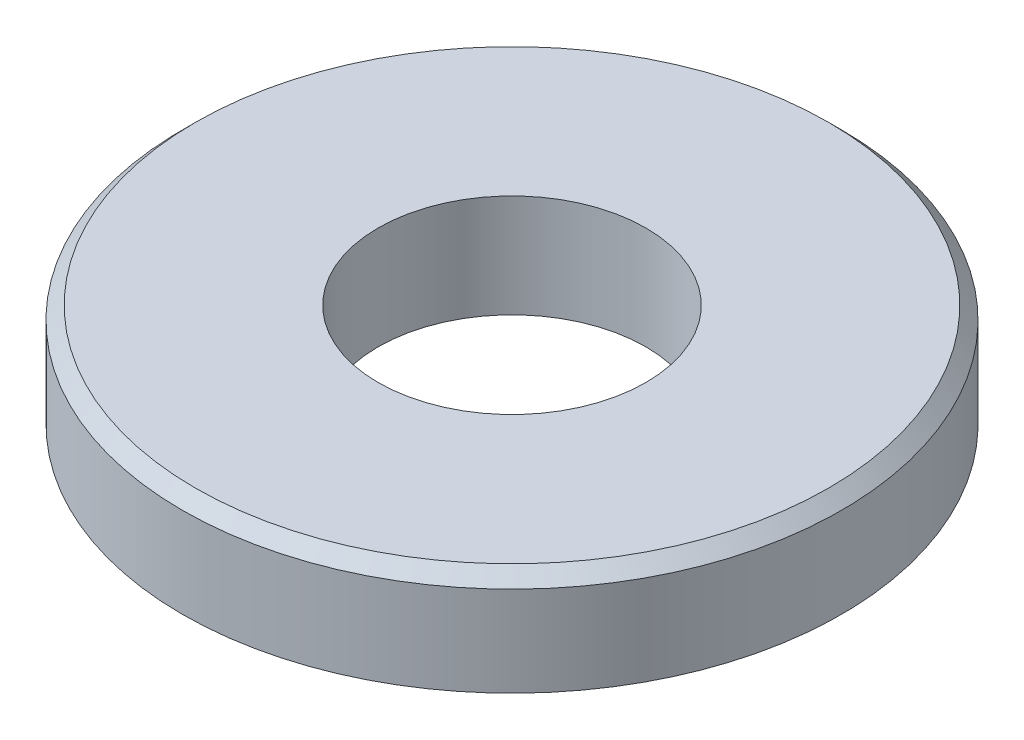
ISO-10303-21;
HEADER;
FILE_DESCRIPTION(('STEP AP214'),'2;1');
FILE_NAME('part.step','',(''),(''),'','','');
FILE_SCHEMA(('AUTOMOTIVE_DESIGN { 1 0 10303 214 1 1 1 1 }'));
ENDSEC;
DATA;
#1=APPLICATION_CONTEXT('core data for automotive mechanical design processes');
#2=APPLICATION_PROTOCOL_DEFINITION('international standard','automotive_design',2000,#1);
#3=PRODUCT_CONTEXT('',#1,'mechanical');
#4=PRODUCT('Part','Part','',(#3));
#5=PRODUCT_RELATED_PRODUCT_CATEGORY('part','',(#4));
#6=PRODUCT_DEFINITION_FORMATION('','',#4);
#7=PRODUCT_DEFINITION_CONTEXT('part definition',#1,'design');
#8=PRODUCT_DEFINITION('design','',#6,#7);
#9=PRODUCT_DEFINITION_SHAPE('','',#8);
#10=(LENGTH_UNIT() NAMED_UNIT(*) SI_UNIT(.MILLI.,.METRE.));
#11=(NAMED_UNIT(*) PLANE_ANGLE_UNIT() SI_UNIT($,.RADIAN.));
#12=(NAMED_UNIT(*) SI_UNIT($,.STERADIAN.) SOLID_ANGLE_UNIT());
#13=UNCERTAINTY_MEASURE_WITH_UNIT(LENGTH_MEASURE(1.E-05),#10,'distance_accuracy_value','');
#14=(GEOMETRIC_REPRESENTATION_CONTEXT(3) GLOBAL_UNCERTAINTY_ASSIGNED_CONTEXT((#13)) GLOBAL_UNIT_ASSIGNED_CONTEXT((#10,
#11,#12)) REPRESENTATION_CONTEXT('',''));
#15=CARTESIAN_POINT('',(0.,0.,0.));
#16=DIRECTION('',(0.,0.,1.));
#17=DIRECTION('',(1.,0.,0.));
#18=AXIS2_PLACEMENT_3D('',#15,#16,#17);
#19=CARTESIAN_POINT('',(0.,5.,0.));
#20=DIRECTION('',(0.,1.,0.));
#21=DIRECTION('',(0.,0.,1.));
#22=AXIS2_PLACEMENT_3D('',#19,#20,#21);
#23=PLANE('',#22);
#24=CARTESIAN_POINT('',(0.,5.,0.));
#25=DIRECTION('',(0.,1.,0.));
#26=DIRECTION('',(0.,0.,1.));
#27=AXIS2_PLACEMENT_3D('',#24,#25,#26);
#28=CIRCLE('',#27,15.375);
#29=CARTESIAN_POINT('',(0.,5.,15.375));
#30=VERTEX_POINT('',#29);
#31=EDGE_CURVE('E40',#30,#30,#28,.T.);
#32=ORIENTED_EDGE('',*,*,#31,.T.);
#33=EDGE_LOOP('',(#32));
#34=FACE_BOUND('',#33,.T.);
#35=CARTESIAN_POINT('',(0.,5.,0.));
#36=DIRECTION('',(0.,1.,0.));
#37=DIRECTION('',(0.,0.,1.));
#38=AXIS2_PLACEMENT_3D('',#35,#36,#37);
#39=CIRCLE('',#38,6.5);
#40=CARTESIAN_POINT('',(0.,5.,6.5));
#41=VERTEX_POINT('',#40);
#42=EDGE_CURVE('E48',#41,#41,#39,.T.);
#43=ORIENTED_EDGE('',*,*,#42,.F.);
#44=EDGE_LOOP('',(#43));
#45=FACE_BOUND('',#44,.T.);
#46=ADVANCED_FACE('F33',(#34,#45),#23,.T.);
#47=CARTESIAN_POINT('',(0.,0.,0.));
#48=DIRECTION('',(0.,1.,0.));
#49=DIRECTION('',(0.,0.,1.));
#50=AXIS2_PLACEMENT_3D('',#47,#48,#49);
#51=PLANE('',#50);
#52=CARTESIAN_POINT('',(0.,0.,0.));
#53=DIRECTION('',(0.,1.,0.));
#54=DIRECTION('',(0.,0.,1.));
#55=AXIS2_PLACEMENT_3D('',#52,#53,#54);
#56=CIRCLE('',#55,16.);
#57=CARTESIAN_POINT('',(0.,0.,16.));
#58=VERTEX_POINT('',#57);
#59=EDGE_CURVE('E44',#58,#58,#56,.T.);
#60=ORIENTED_EDGE('',*,*,#59,.F.);
#61=EDGE_LOOP('',(#60));
#62=FACE_BOUND('',#61,.T.);
#63=CARTESIAN_POINT('',(0.,0.,0.));
#64=DIRECTION('',(0.,1.,0.));
#65=DIRECTION('',(0.,0.,1.));
#66=AXIS2_PLACEMENT_3D('',#63,#64,#65);
#67=CIRCLE('',#66,6.5);
#68=CARTESIAN_POINT('',(0.,0.,6.5));
#69=VERTEX_POINT('',#68);
#70=EDGE_CURVE('E51',#69,#69,#67,.T.);
#71=ORIENTED_EDGE('',*,*,#70,.T.);
#72=EDGE_LOOP('',(#71));
#73=FACE_BOUND('',#72,.T.);
#74=ADVANCED_FACE('F61',(#62,#73),#51,.F.);
#75=CARTESIAN_POINT('',(0.,5.,0.));
#76=DIRECTION('',(0.,-1.,0.));
#77=DIRECTION('',(0.,0.,-1.));
#78=AXIS2_PLACEMENT_3D('',#75,#76,#77);
#79=CYLINDRICAL_SURFACE('',#78,16.);
#80=CARTESIAN_POINT('',(0.,4.375,0.));
#81=DIRECTION('',(0.,1.,0.));
#82=DIRECTION('',(0.,0.,1.));
#83=AXIS2_PLACEMENT_3D('',#80,#81,#82);
#84=CIRCLE('',#83,16.);
#85=CARTESIAN_POINT('',(0.,4.375,16.));
#86=VERTEX_POINT('',#85);
#87=EDGE_CURVE('E10',#86,#86,#84,.F.);
#88=ORIENTED_EDGE('',*,*,#87,.T.);
#89=EDGE_LOOP('',(#88));
#90=FACE_BOUND('',#89,.T.);
#91=ORIENTED_EDGE('',*,*,#59,.T.);
#92=EDGE_LOOP('',(#91));
#93=FACE_BOUND('',#92,.T.);
#94=ADVANCED_FACE('F66',(#90,#93),#79,.T.);
#95=CARTESIAN_POINT('',(0.,5.,0.));
#96=DIRECTION('',(0.,-1.,0.));
#97=DIRECTION('',(0.,0.,-1.));
#98=AXIS2_PLACEMENT_3D('',#95,#96,#97);
#99=CYLINDRICAL_SURFACE('',#98,6.5);
#100=ORIENTED_EDGE('',*,*,#42,.T.);
#101=EDGE_LOOP('',(#100));
#102=FACE_BOUND('',#101,.T.);
#103=ORIENTED_EDGE('',*,*,#70,.F.);
#104=EDGE_LOOP('',(#103));
#105=FACE_BOUND('',#104,.T.);
#106=ADVANCED_FACE('F57',(#102,#105),#99,.F.);
#107=CARTESIAN_POINT('',(0.,5.,0.));
#108=DIRECTION('',(0.,-1.,0.));
#109=DIRECTION('',(0.,0.,-1.));
#110=AXIS2_PLACEMENT_3D('',#107,#108,#109);
#111=CONICAL_SURFACE('',#110,15.375,0.785398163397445);
#112=ORIENTED_EDGE('',*,*,#87,.F.);
#113=EDGE_LOOP('',(#112));
#114=FACE_BOUND('',#113,.T.);
#115=ORIENTED_EDGE('',*,*,#31,.F.);
#116=EDGE_LOOP('',(#115));
#117=FACE_BOUND('',#116,.T.);
#118=ADVANCED_FACE('F35',(#114,#117),#111,.T.);
#119=CLOSED_SHELL('',(#46,#74,#94,#106,#118));
#120=MANIFOLD_SOLID_BREP('B2',#119);
#121=ADVANCED_BREP_SHAPE_REPRESENTATION('',(#18,#120),#14);
#122=SHAPE_DEFINITION_REPRESENTATION(#9,#121);
ENDSEC;
END-ISO-10303-21;
